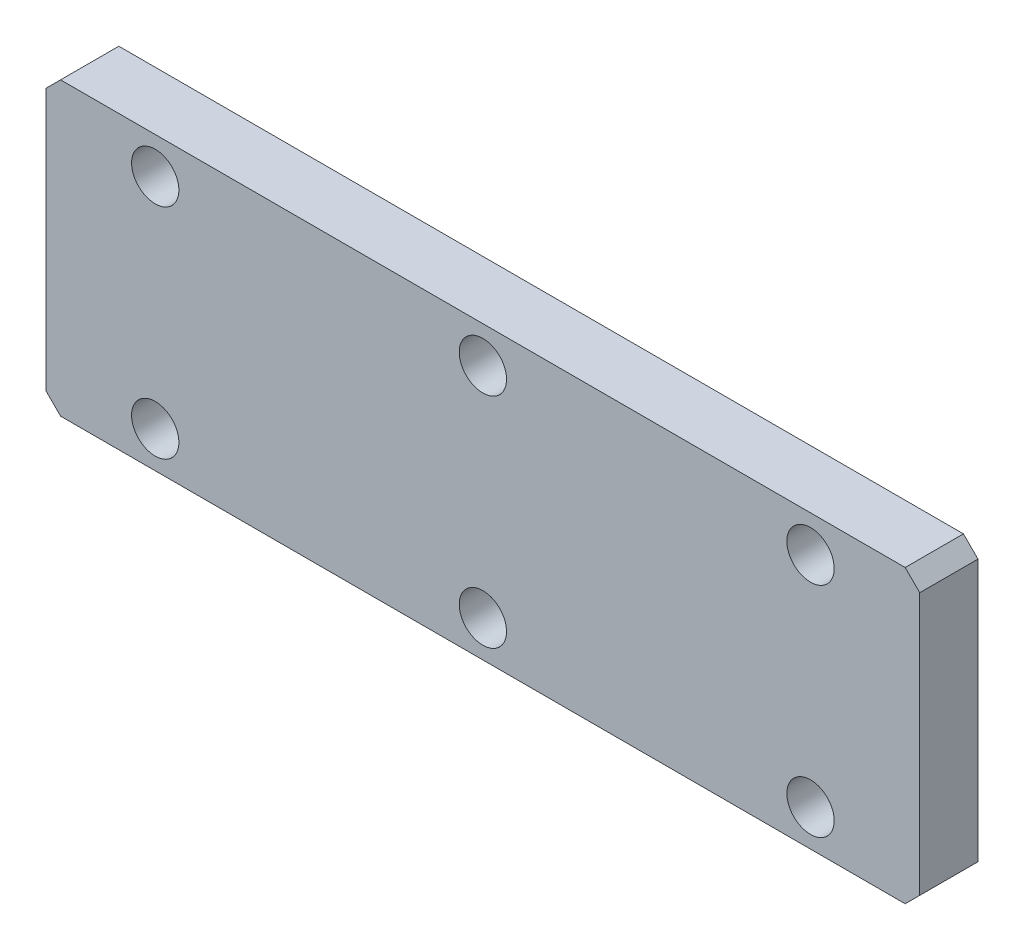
ISO-10303-21;
HEADER;
FILE_DESCRIPTION(('STEP AP214'),'2;1');
FILE_NAME('part.step','',(''),(''),'','','');
FILE_SCHEMA(('AUTOMOTIVE_DESIGN { 1 0 10303 214 1 1 1 1 }'));
ENDSEC;
DATA;
#1=APPLICATION_CONTEXT('core data for automotive mechanical design processes');
#2=APPLICATION_PROTOCOL_DEFINITION('international standard','automotive_design',2000,#1);
#3=PRODUCT_CONTEXT('',#1,'mechanical');
#4=PRODUCT('Part','Part','',(#3));
#5=PRODUCT_RELATED_PRODUCT_CATEGORY('part','',(#4));
#6=PRODUCT_DEFINITION_FORMATION('','',#4);
#7=PRODUCT_DEFINITION_CONTEXT('part definition',#1,'design');
#8=PRODUCT_DEFINITION('design','',#6,#7);
#9=PRODUCT_DEFINITION_SHAPE('','',#8);
#10=(LENGTH_UNIT() NAMED_UNIT(*) SI_UNIT(.MILLI.,.METRE.));
#11=(NAMED_UNIT(*) PLANE_ANGLE_UNIT() SI_UNIT($,.RADIAN.));
#12=(NAMED_UNIT(*) SI_UNIT($,.STERADIAN.) SOLID_ANGLE_UNIT());
#13=UNCERTAINTY_MEASURE_WITH_UNIT(LENGTH_MEASURE(1.E-05),#10,'distance_accuracy_value','');
#14=(GEOMETRIC_REPRESENTATION_CONTEXT(3) GLOBAL_UNCERTAINTY_ASSIGNED_CONTEXT((#13)) GLOBAL_UNIT_ASSIGNED_CONTEXT((#10,
#11,#12)) REPRESENTATION_CONTEXT('',''));
#15=CARTESIAN_POINT('',(0.,0.,0.));
#16=DIRECTION('',(0.,0.,1.));
#17=DIRECTION('',(1.,0.,0.));
#18=AXIS2_PLACEMENT_3D('',#15,#16,#17);
#19=CARTESIAN_POINT('',(0.,40.,8.));
#20=DIRECTION('',(0.,0.,-1.));
#21=DIRECTION('',(-1.,0.,0.));
#22=AXIS2_PLACEMENT_3D('',#19,#20,#21);
#23=PLANE('',#22);
#24=CARTESIAN_POINT('',(59.9999999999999,34.9999999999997,8.));
#25=DIRECTION('',(0.,0.,1.));
#26=DIRECTION('',(1.,0.,0.));
#27=AXIS2_PLACEMENT_3D('',#24,#25,#26);
#28=CIRCLE('',#27,3.25);
#29=CARTESIAN_POINT('',(63.2499999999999,34.9999999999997,8.));
#30=VERTEX_POINT('',#29);
#31=EDGE_CURVE('E303',#30,#30,#28,.T.);
#32=ORIENTED_EDGE('',*,*,#31,.F.);
#33=EDGE_LOOP('',(#32));
#34=FACE_BOUND('',#33,.T.);
#35=CARTESIAN_POINT('',(15.,4.99999999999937,8.));
#36=DIRECTION('',(0.,0.,1.));
#37=DIRECTION('',(1.,0.,0.));
#38=AXIS2_PLACEMENT_3D('',#35,#36,#37);
#39=CIRCLE('',#38,3.25000000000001);
#40=CARTESIAN_POINT('',(18.25,4.99999999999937,8.));
#41=VERTEX_POINT('',#40);
#42=EDGE_CURVE('E315',#41,#41,#39,.T.);
#43=ORIENTED_EDGE('',*,*,#42,.F.);
#44=EDGE_LOOP('',(#43));
#45=FACE_BOUND('',#44,.T.);
#46=CARTESIAN_POINT('',(105.,5.,8.));
#47=DIRECTION('',(0.,0.,1.));
#48=DIRECTION('',(1.,0.,0.));
#49=AXIS2_PLACEMENT_3D('',#46,#47,#48);
#50=CIRCLE('',#49,3.25000000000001);
#51=CARTESIAN_POINT('',(108.25,5.,8.));
#52=VERTEX_POINT('',#51);
#53=EDGE_CURVE('E127',#52,#52,#50,.T.);
#54=ORIENTED_EDGE('',*,*,#53,.F.);
#55=EDGE_LOOP('',(#54));
#56=FACE_BOUND('',#55,.T.);
#57=DIRECTION('',(0.,-1.,0.));
#58=VECTOR('',#57,1.);
#59=CARTESIAN_POINT('',(0.,0.,8.));
#60=LINE('',#59,#58);
#61=CARTESIAN_POINT('',(0.,38.,8.));
#62=VERTEX_POINT('',#61);
#63=CARTESIAN_POINT('',(0.,2.00000000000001,8.));
#64=VERTEX_POINT('',#63);
#65=EDGE_CURVE('E132',#62,#64,#60,.T.);
#66=ORIENTED_EDGE('',*,*,#65,.T.);
#67=DIRECTION('',(-0.707106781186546,0.707106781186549,0.));
#68=VECTOR('',#67,1.);
#69=CARTESIAN_POINT('',(2.,0.,8.));
#70=LINE('',#69,#68);
#71=CARTESIAN_POINT('',(2.,0.,8.));
#72=VERTEX_POINT('',#71);
#73=EDGE_CURVE('E153',#64,#72,#70,.F.);
#74=ORIENTED_EDGE('',*,*,#73,.T.);
#75=DIRECTION('',(1.,0.,0.));
#76=VECTOR('',#75,1.);
#77=CARTESIAN_POINT('',(0.,0.,8.));
#78=LINE('',#77,#76);
#79=CARTESIAN_POINT('',(118.,0.,8.));
#80=VERTEX_POINT('',#79);
#81=EDGE_CURVE('E114',#72,#80,#78,.T.);
#82=ORIENTED_EDGE('',*,*,#81,.T.);
#83=DIRECTION('',(-0.70710678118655,-0.707106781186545,0.));
#84=VECTOR('',#83,1.);
#85=CARTESIAN_POINT('',(120.,2.,8.));
#86=LINE('',#85,#84);
#87=CARTESIAN_POINT('',(120.,2.,8.));
#88=VERTEX_POINT('',#87);
#89=EDGE_CURVE('E151',#80,#88,#86,.F.);
#90=ORIENTED_EDGE('',*,*,#89,.T.);
#91=DIRECTION('',(0.,1.,0.));
#92=VECTOR('',#91,1.);
#93=CARTESIAN_POINT('',(120.,0.,8.));
#94=LINE('',#93,#92);
#95=CARTESIAN_POINT('',(120.,38.,8.));
#96=VERTEX_POINT('',#95);
#97=EDGE_CURVE('E136',#88,#96,#94,.T.);
#98=ORIENTED_EDGE('',*,*,#97,.T.);
#99=DIRECTION('',(0.707106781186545,-0.70710678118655,0.));
#100=VECTOR('',#99,1.);
#101=CARTESIAN_POINT('',(118.,40.,8.));
#102=LINE('',#101,#100);
#103=CARTESIAN_POINT('',(118.,40.,8.));
#104=VERTEX_POINT('',#103);
#105=EDGE_CURVE('E49',#96,#104,#102,.F.);
#106=ORIENTED_EDGE('',*,*,#105,.T.);
#107=DIRECTION('',(-1.,0.,0.));
#108=VECTOR('',#107,1.);
#109=CARTESIAN_POINT('',(0.,40.,8.));
#110=LINE('',#109,#108);
#111=CARTESIAN_POINT('',(2.00000000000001,40.,8.));
#112=VERTEX_POINT('',#111);
#113=EDGE_CURVE('E138',#104,#112,#110,.T.);
#114=ORIENTED_EDGE('',*,*,#113,.T.);
#115=DIRECTION('',(0.707106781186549,0.707106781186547,0.));
#116=VECTOR('',#115,1.);
#117=CARTESIAN_POINT('',(0.,38.,8.));
#118=LINE('',#117,#116);
#119=EDGE_CURVE('E148',#112,#62,#118,.F.);
#120=ORIENTED_EDGE('',*,*,#119,.T.);
#121=EDGE_LOOP('',(#66,#74,#82,#90,#98,#106,#114,#120));
#122=FACE_BOUND('',#121,.T.);
#123=CARTESIAN_POINT('',(60.,4.99999999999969,8.));
#124=DIRECTION('',(0.,0.,1.));
#125=DIRECTION('',(1.,0.,0.));
#126=AXIS2_PLACEMENT_3D('',#123,#124,#125);
#127=CIRCLE('',#126,3.25000000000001);
#128=CARTESIAN_POINT('',(63.25,4.99999999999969,8.));
#129=VERTEX_POINT('',#128);
#130=EDGE_CURVE('E321',#129,#129,#127,.T.);
#131=ORIENTED_EDGE('',*,*,#130,.F.);
#132=EDGE_LOOP('',(#131));
#133=FACE_BOUND('',#132,.T.);
#134=CARTESIAN_POINT('',(105.,35.,8.));
#135=DIRECTION('',(0.,0.,1.));
#136=DIRECTION('',(1.,0.,0.));
#137=AXIS2_PLACEMENT_3D('',#134,#135,#136);
#138=CIRCLE('',#137,3.25000000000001);
#139=CARTESIAN_POINT('',(108.25,35.,8.));
#140=VERTEX_POINT('',#139);
#141=EDGE_CURVE('E309',#140,#140,#138,.T.);
#142=ORIENTED_EDGE('',*,*,#141,.F.);
#143=EDGE_LOOP('',(#142));
#144=FACE_BOUND('',#143,.T.);
#145=CARTESIAN_POINT('',(14.9999999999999,34.9999999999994,8.));
#146=DIRECTION('',(0.,0.,1.));
#147=DIRECTION('',(1.,0.,0.));
#148=AXIS2_PLACEMENT_3D('',#145,#146,#147);
#149=CIRCLE('',#148,3.25000000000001);
#150=CARTESIAN_POINT('',(18.2499999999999,34.9999999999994,8.));
#151=VERTEX_POINT('',#150);
#152=EDGE_CURVE('E292',#151,#151,#149,.T.);
#153=ORIENTED_EDGE('',*,*,#152,.F.);
#154=EDGE_LOOP('',(#153));
#155=FACE_BOUND('',#154,.T.);
#156=ADVANCED_FACE('F28',(#34,#45,#56,#122,#133,#144,#155),#23,.F.);
#157=CARTESIAN_POINT('',(0.,40.,0.));
#158=DIRECTION('',(0.,0.,-1.));
#159=DIRECTION('',(-1.,0.,0.));
#160=AXIS2_PLACEMENT_3D('',#157,#158,#159);
#161=PLANE('',#160);
#162=CARTESIAN_POINT('',(59.9999999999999,34.9999999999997,0.));
#163=DIRECTION('',(0.,0.,1.));
#164=DIRECTION('',(1.,0.,0.));
#165=AXIS2_PLACEMENT_3D('',#162,#163,#164);
#166=CIRCLE('',#165,3.25);
#167=CARTESIAN_POINT('',(63.2499999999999,34.9999999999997,0.));
#168=VERTEX_POINT('',#167);
#169=EDGE_CURVE('E298',#168,#168,#166,.T.);
#170=ORIENTED_EDGE('',*,*,#169,.T.);
#171=EDGE_LOOP('',(#170));
#172=FACE_BOUND('',#171,.T.);
#173=CARTESIAN_POINT('',(15.,4.99999999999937,0.));
#174=DIRECTION('',(0.,0.,1.));
#175=DIRECTION('',(1.,0.,0.));
#176=AXIS2_PLACEMENT_3D('',#173,#174,#175);
#177=CIRCLE('',#176,3.25000000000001);
#178=CARTESIAN_POINT('',(18.25,4.99999999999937,0.));
#179=VERTEX_POINT('',#178);
#180=EDGE_CURVE('E312',#179,#179,#177,.T.);
#181=ORIENTED_EDGE('',*,*,#180,.T.);
#182=EDGE_LOOP('',(#181));
#183=FACE_BOUND('',#182,.T.);
#184=CARTESIAN_POINT('',(105.,5.,0.));
#185=DIRECTION('',(0.,0.,1.));
#186=DIRECTION('',(1.,0.,0.));
#187=AXIS2_PLACEMENT_3D('',#184,#185,#186);
#188=CIRCLE('',#187,3.25000000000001);
#189=CARTESIAN_POINT('',(108.25,5.,0.));
#190=VERTEX_POINT('',#189);
#191=EDGE_CURVE('E324',#190,#190,#188,.T.);
#192=ORIENTED_EDGE('',*,*,#191,.T.);
#193=EDGE_LOOP('',(#192));
#194=FACE_BOUND('',#193,.T.);
#195=DIRECTION('',(1.,0.,0.));
#196=VECTOR('',#195,1.);
#197=CARTESIAN_POINT('',(0.,0.,0.));
#198=LINE('',#197,#196);
#199=CARTESIAN_POINT('',(1.99999999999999,0.,0.));
#200=VERTEX_POINT('',#199);
#201=CARTESIAN_POINT('',(118.,0.,0.));
#202=VERTEX_POINT('',#201);
#203=EDGE_CURVE('E111',#200,#202,#198,.T.);
#204=ORIENTED_EDGE('',*,*,#203,.F.);
#205=DIRECTION('',(0.707106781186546,-0.707106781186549,0.));
#206=VECTOR('',#205,1.);
#207=CARTESIAN_POINT('',(-19.,21.0000000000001,0.));
#208=LINE('',#207,#206);
#209=CARTESIAN_POINT('',(0.,2.00000000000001,0.));
#210=VERTEX_POINT('',#209);
#211=EDGE_CURVE('E94',#200,#210,#208,.F.);
#212=ORIENTED_EDGE('',*,*,#211,.T.);
#213=DIRECTION('',(0.,-1.,0.));
#214=VECTOR('',#213,1.);
#215=CARTESIAN_POINT('',(0.,0.,0.));
#216=LINE('',#215,#214);
#217=CARTESIAN_POINT('',(0.,38.,0.));
#218=VERTEX_POINT('',#217);
#219=EDGE_CURVE('E122',#218,#210,#216,.T.);
#220=ORIENTED_EDGE('',*,*,#219,.F.);
#221=DIRECTION('',(-0.707106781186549,-0.707106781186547,0.));
#222=VECTOR('',#221,1.);
#223=CARTESIAN_POINT('',(1.,39.,0.));
#224=LINE('',#223,#222);
#225=CARTESIAN_POINT('',(2.00000000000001,40.,0.));
#226=VERTEX_POINT('',#225);
#227=EDGE_CURVE('E115',#218,#226,#224,.F.);
#228=ORIENTED_EDGE('',*,*,#227,.T.);
#229=DIRECTION('',(-1.,0.,0.));
#230=VECTOR('',#229,1.);
#231=CARTESIAN_POINT('',(0.,40.,0.));
#232=LINE('',#231,#230);
#233=CARTESIAN_POINT('',(118.,40.,0.));
#234=VERTEX_POINT('',#233);
#235=EDGE_CURVE('E125',#234,#226,#232,.T.);
#236=ORIENTED_EDGE('',*,*,#235,.F.);
#237=DIRECTION('',(-0.707106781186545,0.70710678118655,0.));
#238=VECTOR('',#237,1.);
#239=CARTESIAN_POINT('',(59.0000000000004,99.,0.));
#240=LINE('',#239,#238);
#241=CARTESIAN_POINT('',(120.,38.,0.));
#242=VERTEX_POINT('',#241);
#243=EDGE_CURVE('E142',#234,#242,#240,.F.);
#244=ORIENTED_EDGE('',*,*,#243,.T.);
#245=DIRECTION('',(0.,1.,0.));
#246=VECTOR('',#245,1.);
#247=CARTESIAN_POINT('',(120.,0.,0.));
#248=LINE('',#247,#246);
#249=CARTESIAN_POINT('',(120.,2.,0.));
#250=VERTEX_POINT('',#249);
#251=EDGE_CURVE('E121',#250,#242,#248,.T.);
#252=ORIENTED_EDGE('',*,*,#251,.F.);
#253=DIRECTION('',(0.70710678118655,0.707106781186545,0.));
#254=VECTOR('',#253,1.);
#255=CARTESIAN_POINT('',(78.9999999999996,-39.0000000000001,0.));
#256=LINE('',#255,#254);
#257=EDGE_CURVE('E105',#250,#202,#256,.F.);
#258=ORIENTED_EDGE('',*,*,#257,.T.);
#259=EDGE_LOOP('',(#204,#212,#220,#228,#236,#244,#252,#258));
#260=FACE_BOUND('',#259,.T.);
#261=CARTESIAN_POINT('',(60.,4.99999999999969,0.));
#262=DIRECTION('',(0.,0.,1.));
#263=DIRECTION('',(1.,0.,0.));
#264=AXIS2_PLACEMENT_3D('',#261,#262,#263);
#265=CIRCLE('',#264,3.25000000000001);
#266=CARTESIAN_POINT('',(63.25,4.99999999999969,0.));
#267=VERTEX_POINT('',#266);
#268=EDGE_CURVE('E318',#267,#267,#265,.T.);
#269=ORIENTED_EDGE('',*,*,#268,.T.);
#270=EDGE_LOOP('',(#269));
#271=FACE_BOUND('',#270,.T.);
#272=CARTESIAN_POINT('',(105.,35.,0.));
#273=DIRECTION('',(0.,0.,1.));
#274=DIRECTION('',(1.,0.,0.));
#275=AXIS2_PLACEMENT_3D('',#272,#273,#274);
#276=CIRCLE('',#275,3.25000000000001);
#277=CARTESIAN_POINT('',(108.25,35.,0.));
#278=VERTEX_POINT('',#277);
#279=EDGE_CURVE('E306',#278,#278,#276,.T.);
#280=ORIENTED_EDGE('',*,*,#279,.T.);
#281=EDGE_LOOP('',(#280));
#282=FACE_BOUND('',#281,.T.);
#283=CARTESIAN_POINT('',(14.9999999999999,34.9999999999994,0.));
#284=DIRECTION('',(0.,0.,1.));
#285=DIRECTION('',(1.,0.,0.));
#286=AXIS2_PLACEMENT_3D('',#283,#284,#285);
#287=CIRCLE('',#286,3.25000000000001);
#288=CARTESIAN_POINT('',(18.2499999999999,34.9999999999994,0.));
#289=VERTEX_POINT('',#288);
#290=EDGE_CURVE('E295',#289,#289,#287,.T.);
#291=ORIENTED_EDGE('',*,*,#290,.T.);
#292=EDGE_LOOP('',(#291));
#293=FACE_BOUND('',#292,.T.);
#294=ADVANCED_FACE('F118',(#172,#183,#194,#260,#271,#282,#293),#161,.T.);
#295=CARTESIAN_POINT('',(0.,0.,8.));
#296=DIRECTION('',(1.,0.,0.));
#297=DIRECTION('',(0.,0.,-1.));
#298=AXIS2_PLACEMENT_3D('',#295,#296,#297);
#299=PLANE('',#298);
#300=ORIENTED_EDGE('',*,*,#219,.T.);
#301=DIRECTION('',(0.,0.,1.));
#302=VECTOR('',#301,1.);
#303=CARTESIAN_POINT('',(0.,2.00000000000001,8.));
#304=LINE('',#303,#302);
#305=EDGE_CURVE('E99',#210,#64,#304,.T.);
#306=ORIENTED_EDGE('',*,*,#305,.T.);
#307=ORIENTED_EDGE('',*,*,#65,.F.);
#308=DIRECTION('',(0.,0.,-1.));
#309=VECTOR('',#308,1.);
#310=CARTESIAN_POINT('',(0.,38.,8.));
#311=LINE('',#310,#309);
#312=EDGE_CURVE('E104',#62,#218,#311,.T.);
#313=ORIENTED_EDGE('',*,*,#312,.T.);
#314=EDGE_LOOP('',(#300,#306,#307,#313));
#315=FACE_BOUND('',#314,.T.);
#316=ADVANCED_FACE('F30',(#315),#299,.F.);
#317=CARTESIAN_POINT('',(0.,0.,8.));
#318=DIRECTION('',(0.,1.,0.));
#319=DIRECTION('',(0.,0.,1.));
#320=AXIS2_PLACEMENT_3D('',#317,#318,#319);
#321=PLANE('',#320);
#322=ORIENTED_EDGE('',*,*,#81,.F.);
#323=DIRECTION('',(0.,0.,-1.));
#324=VECTOR('',#323,1.);
#325=CARTESIAN_POINT('',(2.,0.,8.));
#326=LINE('',#325,#324);
#327=EDGE_CURVE('E98',#72,#200,#326,.T.);
#328=ORIENTED_EDGE('',*,*,#327,.T.);
#329=ORIENTED_EDGE('',*,*,#203,.T.);
#330=DIRECTION('',(0.,0.,1.));
#331=VECTOR('',#330,1.);
#332=CARTESIAN_POINT('',(118.,0.,8.));
#333=LINE('',#332,#331);
#334=EDGE_CURVE('E116',#202,#80,#333,.T.);
#335=ORIENTED_EDGE('',*,*,#334,.T.);
#336=EDGE_LOOP('',(#322,#328,#329,#335));
#337=FACE_BOUND('',#336,.T.);
#338=ADVANCED_FACE('F110',(#337),#321,.F.);
#339=CARTESIAN_POINT('',(120.,0.,8.));
#340=DIRECTION('',(-1.,0.,0.));
#341=DIRECTION('',(0.,0.,1.));
#342=AXIS2_PLACEMENT_3D('',#339,#340,#341);
#343=PLANE('',#342);
#344=ORIENTED_EDGE('',*,*,#97,.F.);
#345=DIRECTION('',(0.,0.,-1.));
#346=VECTOR('',#345,1.);
#347=CARTESIAN_POINT('',(120.,2.,8.));
#348=LINE('',#347,#346);
#349=EDGE_CURVE('E157',#88,#250,#348,.T.);
#350=ORIENTED_EDGE('',*,*,#349,.T.);
#351=ORIENTED_EDGE('',*,*,#251,.T.);
#352=DIRECTION('',(0.,0.,1.));
#353=VECTOR('',#352,1.);
#354=CARTESIAN_POINT('',(120.,38.,8.));
#355=LINE('',#354,#353);
#356=EDGE_CURVE('E155',#242,#96,#355,.T.);
#357=ORIENTED_EDGE('',*,*,#356,.T.);
#358=EDGE_LOOP('',(#344,#350,#351,#357));
#359=FACE_BOUND('',#358,.T.);
#360=ADVANCED_FACE('F162',(#359),#343,.F.);
#361=CARTESIAN_POINT('',(0.,40.,8.));
#362=DIRECTION('',(0.,-1.,0.));
#363=DIRECTION('',(0.,0.,-1.));
#364=AXIS2_PLACEMENT_3D('',#361,#362,#363);
#365=PLANE('',#364);
#366=ORIENTED_EDGE('',*,*,#113,.F.);
#367=DIRECTION('',(0.,0.,-1.));
#368=VECTOR('',#367,1.);
#369=CARTESIAN_POINT('',(118.,40.,8.));
#370=LINE('',#369,#368);
#371=EDGE_CURVE('E11',#104,#234,#370,.T.);
#372=ORIENTED_EDGE('',*,*,#371,.T.);
#373=ORIENTED_EDGE('',*,*,#235,.T.);
#374=DIRECTION('',(0.,0.,1.));
#375=VECTOR('',#374,1.);
#376=CARTESIAN_POINT('',(2.00000000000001,40.,8.));
#377=LINE('',#376,#375);
#378=EDGE_CURVE('E36',#226,#112,#377,.T.);
#379=ORIENTED_EDGE('',*,*,#378,.T.);
#380=EDGE_LOOP('',(#366,#372,#373,#379));
#381=FACE_BOUND('',#380,.T.);
#382=ADVANCED_FACE('F170',(#381),#365,.F.);
#383=CARTESIAN_POINT('',(105.,5.,8.));
#384=DIRECTION('',(0.,0.,-1.));
#385=DIRECTION('',(-1.,0.,0.));
#386=AXIS2_PLACEMENT_3D('',#383,#384,#385);
#387=CYLINDRICAL_SURFACE('',#386,3.25000000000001);
#388=ORIENTED_EDGE('',*,*,#53,.T.);
#389=EDGE_LOOP('',(#388));
#390=FACE_BOUND('',#389,.T.);
#391=ORIENTED_EDGE('',*,*,#191,.F.);
#392=EDGE_LOOP('',(#391));
#393=FACE_BOUND('',#392,.T.);
#394=ADVANCED_FACE('F203',(#390,#393),#387,.F.);
#395=CARTESIAN_POINT('',(60.,4.99999999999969,8.));
#396=DIRECTION('',(0.,0.,-1.));
#397=DIRECTION('',(-1.,0.,0.));
#398=AXIS2_PLACEMENT_3D('',#395,#396,#397);
#399=CYLINDRICAL_SURFACE('',#398,3.25000000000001);
#400=ORIENTED_EDGE('',*,*,#130,.T.);
#401=EDGE_LOOP('',(#400));
#402=FACE_BOUND('',#401,.T.);
#403=ORIENTED_EDGE('',*,*,#268,.F.);
#404=EDGE_LOOP('',(#403));
#405=FACE_BOUND('',#404,.T.);
#406=ADVANCED_FACE('F234',(#402,#405),#399,.F.);
#407=CARTESIAN_POINT('',(15.,4.99999999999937,8.));
#408=DIRECTION('',(0.,0.,-1.));
#409=DIRECTION('',(-1.,0.,0.));
#410=AXIS2_PLACEMENT_3D('',#407,#408,#409);
#411=CYLINDRICAL_SURFACE('',#410,3.25000000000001);
#412=ORIENTED_EDGE('',*,*,#42,.T.);
#413=EDGE_LOOP('',(#412));
#414=FACE_BOUND('',#413,.T.);
#415=ORIENTED_EDGE('',*,*,#180,.F.);
#416=EDGE_LOOP('',(#415));
#417=FACE_BOUND('',#416,.T.);
#418=ADVANCED_FACE('F241',(#414,#417),#411,.F.);
#419=CARTESIAN_POINT('',(105.,35.,8.));
#420=DIRECTION('',(0.,0.,-1.));
#421=DIRECTION('',(-1.,0.,0.));
#422=AXIS2_PLACEMENT_3D('',#419,#420,#421);
#423=CYLINDRICAL_SURFACE('',#422,3.25000000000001);
#424=ORIENTED_EDGE('',*,*,#141,.T.);
#425=EDGE_LOOP('',(#424));
#426=FACE_BOUND('',#425,.T.);
#427=ORIENTED_EDGE('',*,*,#279,.F.);
#428=EDGE_LOOP('',(#427));
#429=FACE_BOUND('',#428,.T.);
#430=ADVANCED_FACE('F249',(#426,#429),#423,.F.);
#431=CARTESIAN_POINT('',(59.9999999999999,34.9999999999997,8.));
#432=DIRECTION('',(0.,0.,-1.));
#433=DIRECTION('',(-1.,0.,0.));
#434=AXIS2_PLACEMENT_3D('',#431,#432,#433);
#435=CYLINDRICAL_SURFACE('',#434,3.25);
#436=ORIENTED_EDGE('',*,*,#31,.T.);
#437=EDGE_LOOP('',(#436));
#438=FACE_BOUND('',#437,.T.);
#439=ORIENTED_EDGE('',*,*,#169,.F.);
#440=EDGE_LOOP('',(#439));
#441=FACE_BOUND('',#440,.T.);
#442=ADVANCED_FACE('F257',(#438,#441),#435,.F.);
#443=CARTESIAN_POINT('',(14.9999999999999,34.9999999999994,8.));
#444=DIRECTION('',(0.,0.,-1.));
#445=DIRECTION('',(-1.,0.,0.));
#446=AXIS2_PLACEMENT_3D('',#443,#444,#445);
#447=CYLINDRICAL_SURFACE('',#446,3.25000000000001);
#448=ORIENTED_EDGE('',*,*,#152,.T.);
#449=EDGE_LOOP('',(#448));
#450=FACE_BOUND('',#449,.T.);
#451=ORIENTED_EDGE('',*,*,#290,.F.);
#452=EDGE_LOOP('',(#451));
#453=FACE_BOUND('',#452,.T.);
#454=ADVANCED_FACE('F186',(#450,#453),#447,.F.);
#455=CARTESIAN_POINT('',(2.,0.,8.));
#456=DIRECTION('',(0.707106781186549,0.707106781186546,0.));
#457=DIRECTION('',(-0.707106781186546,0.707106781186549,0.));
#458=AXIS2_PLACEMENT_3D('',#455,#456,#457);
#459=PLANE('',#458);
#460=ORIENTED_EDGE('',*,*,#73,.F.);
#461=ORIENTED_EDGE('',*,*,#305,.F.);
#462=ORIENTED_EDGE('',*,*,#211,.F.);
#463=ORIENTED_EDGE('',*,*,#327,.F.);
#464=EDGE_LOOP('',(#460,#461,#462,#463));
#465=FACE_BOUND('',#464,.T.);
#466=ADVANCED_FACE('F97',(#465),#459,.F.);
#467=CARTESIAN_POINT('',(120.,2.,8.));
#468=DIRECTION('',(-0.707106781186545,0.70710678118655,0.));
#469=DIRECTION('',(-0.70710678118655,-0.707106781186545,0.));
#470=AXIS2_PLACEMENT_3D('',#467,#468,#469);
#471=PLANE('',#470);
#472=ORIENTED_EDGE('',*,*,#89,.F.);
#473=ORIENTED_EDGE('',*,*,#334,.F.);
#474=ORIENTED_EDGE('',*,*,#257,.F.);
#475=ORIENTED_EDGE('',*,*,#349,.F.);
#476=EDGE_LOOP('',(#472,#473,#474,#475));
#477=FACE_BOUND('',#476,.T.);
#478=ADVANCED_FACE('F178',(#477),#471,.F.);
#479=CARTESIAN_POINT('',(118.,40.,8.));
#480=DIRECTION('',(-0.70710678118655,-0.707106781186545,0.));
#481=DIRECTION('',(0.707106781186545,-0.70710678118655,0.));
#482=AXIS2_PLACEMENT_3D('',#479,#480,#481);
#483=PLANE('',#482);
#484=ORIENTED_EDGE('',*,*,#105,.F.);
#485=ORIENTED_EDGE('',*,*,#356,.F.);
#486=ORIENTED_EDGE('',*,*,#243,.F.);
#487=ORIENTED_EDGE('',*,*,#371,.F.);
#488=EDGE_LOOP('',(#484,#485,#486,#487));
#489=FACE_BOUND('',#488,.T.);
#490=ADVANCED_FACE('F169',(#489),#483,.F.);
#491=CARTESIAN_POINT('',(0.,38.,8.));
#492=DIRECTION('',(0.707106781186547,-0.707106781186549,0.));
#493=DIRECTION('',(0.707106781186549,0.707106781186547,0.));
#494=AXIS2_PLACEMENT_3D('',#491,#492,#493);
#495=PLANE('',#494);
#496=ORIENTED_EDGE('',*,*,#119,.F.);
#497=ORIENTED_EDGE('',*,*,#378,.F.);
#498=ORIENTED_EDGE('',*,*,#227,.F.);
#499=ORIENTED_EDGE('',*,*,#312,.F.);
#500=EDGE_LOOP('',(#496,#497,#498,#499));
#501=FACE_BOUND('',#500,.T.);
#502=ADVANCED_FACE('F176',(#501),#495,.F.);
#503=CLOSED_SHELL('',(#156,#294,#316,#338,#360,#382,#394,#406,#418,#430,#442,#454,#466,#478,
#490,#502));
#504=MANIFOLD_SOLID_BREP('B2',#503);
#505=ADVANCED_BREP_SHAPE_REPRESENTATION('',(#18,#504),#14);
#506=SHAPE_DEFINITION_REPRESENTATION(#9,#505);
ENDSEC;
END-ISO-10303-21;
